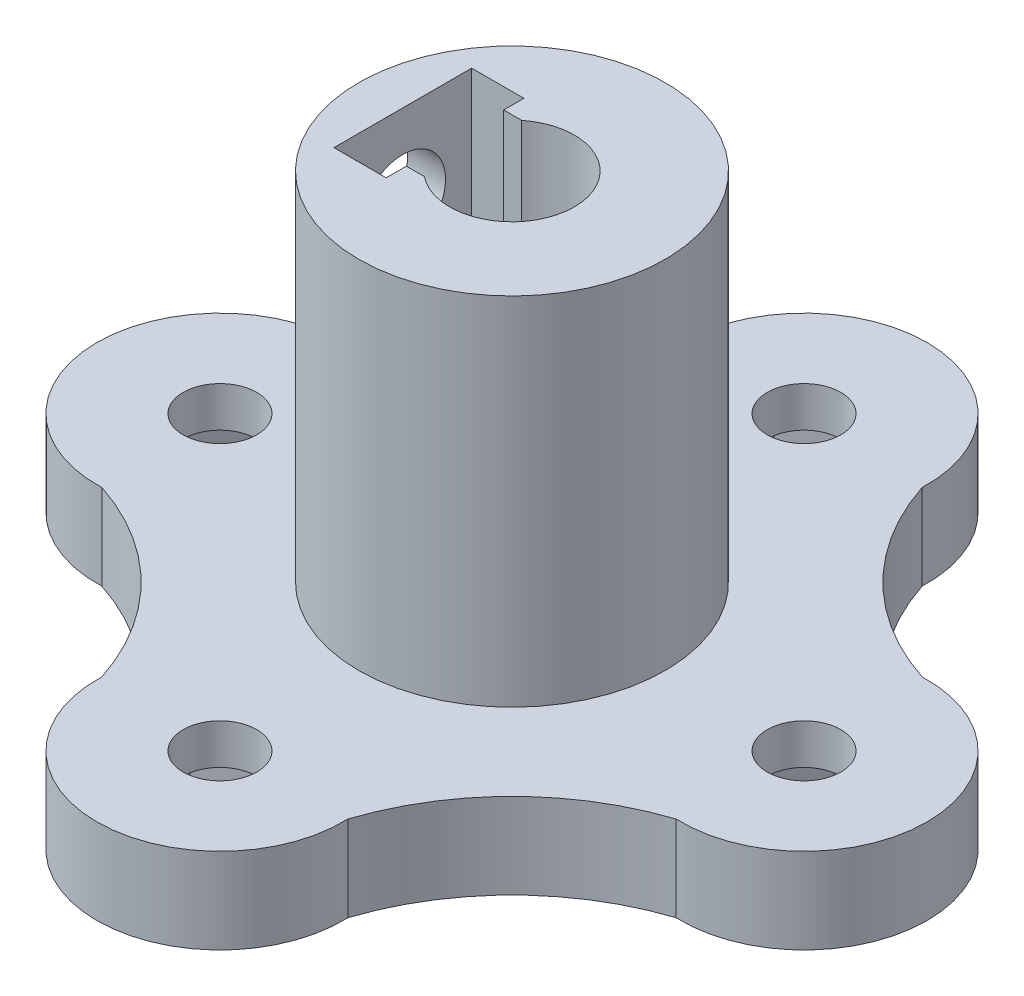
from build123d import *

# Parameters (mm, degrees)
SKETCH1_R                = 15.25
SKETCH1_R_2              = 2.625
SKETCH1_R_3              = 1.55
BOSS_EXTRUDE1_DEPTH      = 3.6
SKETCH2_R                = 6.45
SKETCH2_R_2              = 2.625
BOSS_EXTRUDE2_DEPTH      = 15
SKETCH4_W                = 2.2
SKETCH4_H                = 5.8
CUT_EXTRUDE4_DEPTH       = 7
BOSS_EXTRUDE3_START      = -3.6
SKETCH5_R                = 5.185
SKETCH5_R_2              = 1.55
BOSS_EXTRUDE3_DEPTH      = 3.6
CUT_EXTRUDE5_REACH       = 30.921
CIRPATTERN1_COUNT        = 4
BOSS_EXTRUDE4_START      = -3.6
SKETCH7_R                = 5.185
SKETCH7_R_2              = 1.55
BOSS_EXTRUDE4_DEPTH      = 3.6
CUT_EXTRUDE6_DEPTH       = 1.9
SKETCH9_W                = 4.6
SKETCH9_H                = 4.1
CUT_EXTRUDE7_DEPTH       = 7
M3_CLEARANCE_HOLE1_D     = 3.6
M3_CLEARANCE_HOLE1_DEPTH = 5
M3_CLEARANCE_HOLE1_TIP   = 1.081549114


with BuildPart() as part:
    # Sketch1 → Boss-Extrude1 (new body)
    with BuildSketch(Plane(origin=(0, 0, 0), x_dir=(1, 0, 0), z_dir=(0, 1, 0))):
        with Locations(Location((0, 0, 0), (0, 0, 270))):
            Circle(SKETCH1_R)
        with Locations(Location((0, 0, 0), (0, 0, 270))):
            Circle(SKETCH1_R_2, mode=Mode.SUBTRACT)
        with Locations(Location((0, 12.3, 0), (0, 0, 270))):
            Circle(SKETCH1_R_3, mode=Mode.SUBTRACT)
        with Locations(Location((12.3, 0, 0), (0, 0, 270))):
            Circle(SKETCH1_R_3, mode=Mode.SUBTRACT)
        with Locations(Location((0, -12.3, 0), (0, 0, 270))):
            Circle(SKETCH1_R_3, mode=Mode.SUBTRACT)
        with Locations(Location((-12.3, 0, 0), (0, 0, 270))):
            Circle(SKETCH1_R_3, mode=Mode.SUBTRACT)
    extrude(amount=BOSS_EXTRUDE1_DEPTH)

    # Sketch2 → Boss-Extrude2 (add)
    with BuildSketch(Plane(origin=(0, 3.6, 0), x_dir=(1, 0, 0), z_dir=(0, 1, 0))):
        with Locations(Location((0, 0, 0), (0, 0, 270))):
            Circle(SKETCH2_R)
        with Locations(Location((0, 0, 0), (0, 0, 270))):
            Circle(SKETCH2_R_2, mode=Mode.SUBTRACT)
    extrude(amount=BOSS_EXTRUDE2_DEPTH)

    # Sketch4 → Cut-Extrude4 (cut)
    with BuildSketch(Plane(origin=(0, 18.6, 0), x_dir=(1, 0, 0), z_dir=(0, 1, 0))):
        with Locations((-3.5, 0)):
            Rectangle(SKETCH4_W, SKETCH4_H)
    extrude(amount=-CUT_EXTRUDE4_DEPTH, mode=Mode.SUBTRACT)

    # Sketch5 → Boss-Extrude3 (add)
    # profile 1 of 4: a face of its own
    with BuildSketch(Plane(origin=(0, 3.6, 0), x_dir=(1, 0, 0), z_dir=(0, 1, 0)).offset(BOSS_EXTRUDE3_START)):
        with Locations((0, 12.3)):
            Circle(SKETCH5_R)
        with Locations(Location((0, 12.3, 0), (0, 0, 270))):
            Circle(SKETCH5_R_2, mode=Mode.SUBTRACT)
    # profile 2 of 4: a face of its own
    with BuildSketch(Plane(origin=(0, 3.6, 0), x_dir=(1, 0, 0), z_dir=(0, 1, 0)).offset(BOSS_EXTRUDE3_START)):
        with Locations((12.3, 0)):
            Circle(SKETCH5_R)
        with Locations(Location((12.3, 0, 0), (0, 0, 270))):
            Circle(SKETCH5_R_2, mode=Mode.SUBTRACT)
    # profile 3 of 4: a face of its own
    with BuildSketch(Plane(origin=(0, 3.6, 0), x_dir=(1, 0, 0), z_dir=(0, 1, 0)).offset(BOSS_EXTRUDE3_START)):
        with Locations((0, -12.3)):
            Circle(SKETCH5_R)
        with Locations(Location((0, -12.3, 0), (0, 0, 270))):
            Circle(SKETCH5_R_2, mode=Mode.SUBTRACT)
    # profile 4 of 4: a face of its own
    with BuildSketch(Plane(origin=(0, 3.6, 0), x_dir=(1, 0, 0), z_dir=(0, 1, 0)).offset(BOSS_EXTRUDE3_START)):
        with Locations((-12.3, 0)):
            Circle(SKETCH5_R)
        with Locations(Location((-12.3, 0, 0), (0, 0, 270))):
            Circle(SKETCH5_R_2, mode=Mode.SUBTRACT)
    extrude(amount=BOSS_EXTRUDE3_DEPTH)

    # Sketch6 → Cut-Extrude5 (cut, up to next)
    with BuildSketch(Plane(origin=(0, 3.6, 0), x_dir=(1, 0, 0), z_dir=(0, 1, 0)), mode=Mode.PRIVATE) as cut_extrude5_sk1:
        with BuildLine():
            ThreePointArc((4.690002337, 14.510905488), (7.809903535, 7.809903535), (14.510905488, 4.690002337))
            ThreePointArc((14.510905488, 4.690002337), (10.783378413, 10.783378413), (4.690002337, 14.510905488))
        make_face()
    cut_extrude5_tool1 = extrude(cut_extrude5_sk1.sketch, amount=-CUT_EXTRUDE5_REACH, mode=Mode.PRIVATE) & part.part
    cut_extrude5 = cut_extrude5_tool1.solids().sort_by_distance((9.349551, 3.6, -9.349551))[0]
    add(cut_extrude5, mode=Mode.SUBTRACT)

    # CirPattern1: Cut-Extrude5 ×4 about axis
    cirpattern1_axis = Axis((0, 0, 0), (0, 1, 0))
    for i in range(1, CIRPATTERN1_COUNT):
        add(cut_extrude5.rotate(cirpattern1_axis, i * 360 / CIRPATTERN1_COUNT), mode=Mode.SUBTRACT)

    # Sketch7 → Boss-Extrude4 (add)
    # profile 1 of 4: a face of its own
    with BuildSketch(Plane(origin=(0, 3.6, 0), x_dir=(1, 0, 0), z_dir=(0, 1, 0)).offset(BOSS_EXTRUDE4_START)):
        with Locations((0, -12.3)):
            Circle(SKETCH7_R)
        with Locations(Location((0, -12.3, 0), (0, 0, 270))):
            Circle(SKETCH7_R_2, mode=Mode.SUBTRACT)
    # profile 2 of 4: a face of its own
    with BuildSketch(Plane(origin=(0, 3.6, 0), x_dir=(1, 0, 0), z_dir=(0, 1, 0)).offset(BOSS_EXTRUDE4_START)):
        with Locations((-12.3, 0)):
            Circle(SKETCH7_R)
        with Locations(Location((-12.3, 0, 0), (0, 0, 270))):
            Circle(SKETCH7_R_2, mode=Mode.SUBTRACT)
    # profile 3 of 4: a face of its own
    with BuildSketch(Plane(origin=(0, 3.6, 0), x_dir=(1, 0, 0), z_dir=(0, 1, 0)).offset(BOSS_EXTRUDE4_START)):
        with Locations((0, 12.3)):
            Circle(SKETCH7_R)
        with Locations(Location((0, 12.3, 0), (0, 0, 270))):
            Circle(SKETCH7_R_2, mode=Mode.SUBTRACT)
    # profile 4 of 4: a face of its own
    with BuildSketch(Plane(origin=(0, 3.6, 0), x_dir=(1, 0, 0), z_dir=(0, 1, 0)).offset(BOSS_EXTRUDE4_START)):
        with Locations((12.3, 0)):
            Circle(SKETCH7_R)
        with Locations(Location((12.3, 0, 0), (0, 0, 270))):
            Circle(SKETCH7_R_2, mode=Mode.SUBTRACT)
    extrude(amount=BOSS_EXTRUDE4_DEPTH)

    # Sketch8 → Cut-Extrude6 (cut)
    with BuildSketch(Plane.XZ):
        Polygon((0, -8.835898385), (-3, -10.567949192), (-3, -14.032050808), (0, -15.764101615), (3, -14.032050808), (3, -10.567949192), align=None)
        Polygon((-8.835898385, 0), (-10.567949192, 3), (-14.032050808, 3), (-15.764101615, 0), (-14.032050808, -3), (-10.567949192, -3), align=None)
        Polygon((0, 8.835898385), (3, 10.567949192), (3, 14.032050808), (0, 15.764101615), (-3, 14.032050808), (-3, 10.567949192), align=None)
        Polygon((8.835898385, 0), (10.567949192, -3), (14.032050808, -3), (15.764101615, 0), (14.032050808, 3), (10.567949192, 3), align=None)
    extrude(amount=-CUT_EXTRUDE6_DEPTH, mode=Mode.SUBTRACT)

    # Sketch9 → Cut-Extrude7 (cut)
    with BuildSketch(Plane(origin=(0, 18.6, 0), x_dir=(1, 0, 0), z_dir=(0, 1, 0))):
        with Locations((-2.3, 0)):
            Rectangle(SKETCH9_W, SKETCH9_H)
    extrude(amount=-CUT_EXTRUDE7_DEPTH, mode=Mode.SUBTRACT)

    # M3 Clearance Hole1
    with Locations(Plane.ZY.offset(6.45)):
        with Locations((0, 15.1)):
            Hole(M3_CLEARANCE_HOLE1_D / 2, depth=M3_CLEARANCE_HOLE1_DEPTH)
            with Locations((0, 0, -(M3_CLEARANCE_HOLE1_DEPTH + M3_CLEARANCE_HOLE1_TIP / 2))):  # 118° drill point
                Cone(0, M3_CLEARANCE_HOLE1_D / 2, M3_CLEARANCE_HOLE1_TIP, mode=Mode.SUBTRACT)


solid = part.part
